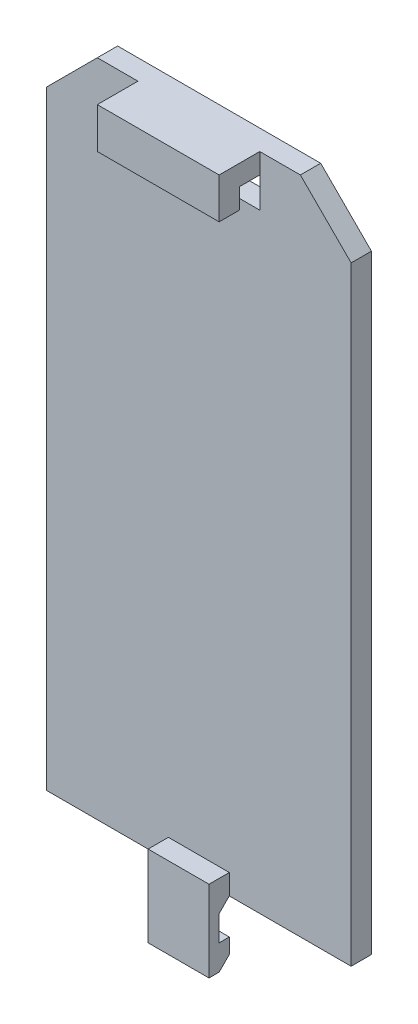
ISO-10303-21;
HEADER;
FILE_DESCRIPTION(('STEP AP214'),'2;1');
FILE_NAME('part.step','',(''),(''),'','','');
FILE_SCHEMA(('AUTOMOTIVE_DESIGN { 1 0 10303 214 1 1 1 1 }'));
ENDSEC;
DATA;
#1=APPLICATION_CONTEXT('core data for automotive mechanical design processes');
#2=APPLICATION_PROTOCOL_DEFINITION('international standard','automotive_design',2000,#1);
#3=PRODUCT_CONTEXT('',#1,'mechanical');
#4=PRODUCT('Part','Part','',(#3));
#5=PRODUCT_RELATED_PRODUCT_CATEGORY('part','',(#4));
#6=PRODUCT_DEFINITION_FORMATION('','',#4);
#7=PRODUCT_DEFINITION_CONTEXT('part definition',#1,'design');
#8=PRODUCT_DEFINITION('design','',#6,#7);
#9=PRODUCT_DEFINITION_SHAPE('','',#8);
#10=(LENGTH_UNIT() NAMED_UNIT(*) SI_UNIT(.MILLI.,.METRE.));
#11=(NAMED_UNIT(*) PLANE_ANGLE_UNIT() SI_UNIT($,.RADIAN.));
#12=(NAMED_UNIT(*) SI_UNIT($,.STERADIAN.) SOLID_ANGLE_UNIT());
#13=UNCERTAINTY_MEASURE_WITH_UNIT(LENGTH_MEASURE(1.E-05),#10,'distance_accuracy_value','');
#14=(GEOMETRIC_REPRESENTATION_CONTEXT(3) GLOBAL_UNCERTAINTY_ASSIGNED_CONTEXT((#13)) GLOBAL_UNIT_ASSIGNED_CONTEXT((#10,
#11,#12)) REPRESENTATION_CONTEXT('',''));
#15=CARTESIAN_POINT('',(0.,0.,0.));
#16=DIRECTION('',(0.,0.,1.));
#17=DIRECTION('',(1.,0.,0.));
#18=AXIS2_PLACEMENT_3D('',#15,#16,#17);
#19=CARTESIAN_POINT('',(-15.,65.,0.));
#20=DIRECTION('',(0.,0.,-1.));
#21=DIRECTION('',(-1.,0.,0.));
#22=AXIS2_PLACEMENT_3D('',#19,#20,#21);
#23=PLANE('',#22);
#24=DIRECTION('',(1.,0.,0.));
#25=VECTOR('',#24,1.);
#26=CARTESIAN_POINT('',(-8.,14.,0.));
#27=LINE('',#26,#25);
#28=CARTESIAN_POINT('',(-8.,14.,0.));
#29=VERTEX_POINT('',#28);
#30=CARTESIAN_POINT('',(8.,14.,0.));
#31=VERTEX_POINT('',#30);
#32=EDGE_CURVE('E337',#29,#31,#27,.T.);
#33=ORIENTED_EDGE('',*,*,#32,.F.);
#34=DIRECTION('',(0.,1.,0.));
#35=VECTOR('',#34,1.);
#36=CARTESIAN_POINT('',(-8.,14.,0.));
#37=LINE('',#36,#35);
#38=CARTESIAN_POINT('',(-8.,12.2,0.));
#39=VERTEX_POINT('',#38);
#40=EDGE_CURVE('E328',#39,#29,#37,.T.);
#41=ORIENTED_EDGE('',*,*,#40,.F.);
#42=DIRECTION('',(1.,0.,0.));
#43=VECTOR('',#42,1.);
#44=CARTESIAN_POINT('',(-8.,12.2,0.));
#45=LINE('',#44,#43);
#46=CARTESIAN_POINT('',(8.,12.2,0.));
#47=VERTEX_POINT('',#46);
#48=EDGE_CURVE('E338',#39,#47,#45,.T.);
#49=ORIENTED_EDGE('',*,*,#48,.T.);
#50=DIRECTION('',(0.,1.,0.));
#51=VECTOR('',#50,1.);
#52=CARTESIAN_POINT('',(8.,14.,0.));
#53=LINE('',#52,#51);
#54=EDGE_CURVE('E319',#47,#31,#53,.T.);
#55=ORIENTED_EDGE('',*,*,#54,.T.);
#56=EDGE_LOOP('',(#33,#41,#49,#55));
#57=FACE_BOUND('',#56,.T.);
#58=DIRECTION('',(1.,0.,0.));
#59=VECTOR('',#58,1.);
#60=CARTESIAN_POINT('',(-8.,10.,0.));
#61=LINE('',#60,#59);
#62=CARTESIAN_POINT('',(-8.,10.,0.));
#63=VERTEX_POINT('',#62);
#64=CARTESIAN_POINT('',(8.,9.99999999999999,0.));
#65=VERTEX_POINT('',#64);
#66=EDGE_CURVE('E388',#63,#65,#61,.T.);
#67=ORIENTED_EDGE('',*,*,#66,.F.);
#68=DIRECTION('',(0.,1.,0.));
#69=VECTOR('',#68,1.);
#70=CARTESIAN_POINT('',(-8.,10.,0.));
#71=LINE('',#70,#69);
#72=CARTESIAN_POINT('',(-8.,8.2,0.));
#73=VERTEX_POINT('',#72);
#74=EDGE_CURVE('E379',#73,#63,#71,.T.);
#75=ORIENTED_EDGE('',*,*,#74,.F.);
#76=DIRECTION('',(1.,0.,0.));
#77=VECTOR('',#76,1.);
#78=CARTESIAN_POINT('',(-8.,8.2,0.));
#79=LINE('',#78,#77);
#80=CARTESIAN_POINT('',(8.,8.2,0.));
#81=VERTEX_POINT('',#80);
#82=EDGE_CURVE('E389',#73,#81,#79,.T.);
#83=ORIENTED_EDGE('',*,*,#82,.T.);
#84=DIRECTION('',(0.,1.,0.));
#85=VECTOR('',#84,1.);
#86=CARTESIAN_POINT('',(8.,10.,0.));
#87=LINE('',#86,#85);
#88=EDGE_CURVE('E366',#81,#65,#87,.T.);
#89=ORIENTED_EDGE('',*,*,#88,.T.);
#90=EDGE_LOOP('',(#67,#75,#83,#89));
#91=FACE_BOUND('',#90,.T.);
#92=DIRECTION('',(0.,-1.,0.));
#93=VECTOR('',#92,1.);
#94=CARTESIAN_POINT('',(-15.,0.,0.));
#95=LINE('',#94,#93);
#96=CARTESIAN_POINT('',(-15.,60.,0.));
#97=VERTEX_POINT('',#96);
#98=CARTESIAN_POINT('',(-15.,0.,0.));
#99=VERTEX_POINT('',#98);
#100=EDGE_CURVE('E592',#97,#99,#95,.T.);
#101=ORIENTED_EDGE('',*,*,#100,.F.);
#102=DIRECTION('',(-0.707106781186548,-0.707106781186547,0.));
#103=VECTOR('',#102,1.);
#104=CARTESIAN_POINT('',(-15.,60.,0.));
#105=LINE('',#104,#103);
#106=CARTESIAN_POINT('',(-10.,65.,0.));
#107=VERTEX_POINT('',#106);
#108=EDGE_CURVE('E603',#107,#97,#105,.T.);
#109=ORIENTED_EDGE('',*,*,#108,.F.);
#110=DIRECTION('',(-1.,0.,0.));
#111=VECTOR('',#110,1.);
#112=CARTESIAN_POINT('',(-10.,65.,0.));
#113=LINE('',#112,#111);
#114=CARTESIAN_POINT('',(10.,65.,0.));
#115=VERTEX_POINT('',#114);
#116=EDGE_CURVE('E601',#115,#107,#113,.T.);
#117=ORIENTED_EDGE('',*,*,#116,.F.);
#118=DIRECTION('',(-0.707106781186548,0.707106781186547,0.));
#119=VECTOR('',#118,1.);
#120=CARTESIAN_POINT('',(10.,65.,0.));
#121=LINE('',#120,#119);
#122=CARTESIAN_POINT('',(15.,60.,0.));
#123=VERTEX_POINT('',#122);
#124=EDGE_CURVE('E599',#123,#115,#121,.T.);
#125=ORIENTED_EDGE('',*,*,#124,.F.);
#126=DIRECTION('',(0.,1.,0.));
#127=VECTOR('',#126,1.);
#128=CARTESIAN_POINT('',(15.,0.,0.));
#129=LINE('',#128,#127);
#130=CARTESIAN_POINT('',(15.,0.,0.));
#131=VERTEX_POINT('',#130);
#132=EDGE_CURVE('E597',#131,#123,#129,.T.);
#133=ORIENTED_EDGE('',*,*,#132,.F.);
#134=DIRECTION('',(1.,0.,0.));
#135=VECTOR('',#134,1.);
#136=CARTESIAN_POINT('',(-15.,0.,0.));
#137=LINE('',#136,#135);
#138=EDGE_CURVE('E595',#99,#131,#137,.T.);
#139=ORIENTED_EDGE('',*,*,#138,.F.);
#140=EDGE_LOOP('',(#101,#109,#117,#125,#133,#139));
#141=FACE_BOUND('',#140,.T.);
#142=DIRECTION('',(0.,-1.,0.));
#143=VECTOR('',#142,1.);
#144=CARTESIAN_POINT('',(-6.,63.,0.));
#145=LINE('',#144,#143);
#146=CARTESIAN_POINT('',(-6.,63.,0.));
#147=VERTEX_POINT('',#146);
#148=CARTESIAN_POINT('',(-6.,60.,0.));
#149=VERTEX_POINT('',#148);
#150=EDGE_CURVE('E568',#147,#149,#145,.T.);
#151=ORIENTED_EDGE('',*,*,#150,.T.);
#152=DIRECTION('',(1.,0.,0.));
#153=VECTOR('',#152,1.);
#154=CARTESIAN_POINT('',(-6.,60.,0.));
#155=LINE('',#154,#153);
#156=CARTESIAN_POINT('',(6.,60.,0.));
#157=VERTEX_POINT('',#156);
#158=EDGE_CURVE('E582',#149,#157,#155,.T.);
#159=ORIENTED_EDGE('',*,*,#158,.T.);
#160=DIRECTION('',(0.,1.,0.));
#161=VECTOR('',#160,1.);
#162=CARTESIAN_POINT('',(6.,63.,0.));
#163=LINE('',#162,#161);
#164=CARTESIAN_POINT('',(6.,63.,0.));
#165=VERTEX_POINT('',#164);
#166=EDGE_CURVE('E537',#157,#165,#163,.T.);
#167=ORIENTED_EDGE('',*,*,#166,.T.);
#168=DIRECTION('',(-1.,0.,0.));
#169=VECTOR('',#168,1.);
#170=CARTESIAN_POINT('',(-6.,63.,0.));
#171=LINE('',#170,#169);
#172=EDGE_CURVE('E565',#165,#147,#171,.T.);
#173=ORIENTED_EDGE('',*,*,#172,.T.);
#174=EDGE_LOOP('',(#151,#159,#167,#173));
#175=FACE_BOUND('',#174,.T.);
#176=DIRECTION('',(1.,0.,0.));
#177=VECTOR('',#176,1.);
#178=CARTESIAN_POINT('',(-8.,8.,0.));
#179=LINE('',#178,#177);
#180=CARTESIAN_POINT('',(-8.,8.,0.));
#181=VERTEX_POINT('',#180);
#182=CARTESIAN_POINT('',(8.,8.,0.));
#183=VERTEX_POINT('',#182);
#184=EDGE_CURVE('E420',#181,#183,#179,.T.);
#185=ORIENTED_EDGE('',*,*,#184,.F.);
#186=DIRECTION('',(0.,1.,0.));
#187=VECTOR('',#186,1.);
#188=CARTESIAN_POINT('',(-8.,8.,0.));
#189=LINE('',#188,#187);
#190=CARTESIAN_POINT('',(-8.,5.,0.));
#191=VERTEX_POINT('',#190);
#192=EDGE_CURVE('E408',#191,#181,#189,.T.);
#193=ORIENTED_EDGE('',*,*,#192,.F.);
#194=DIRECTION('',(1.,0.,0.));
#195=VECTOR('',#194,1.);
#196=CARTESIAN_POINT('',(-8.,5.,0.));
#197=LINE('',#196,#195);
#198=CARTESIAN_POINT('',(8.,5.,0.));
#199=VERTEX_POINT('',#198);
#200=EDGE_CURVE('E421',#191,#199,#197,.T.);
#201=ORIENTED_EDGE('',*,*,#200,.T.);
#202=DIRECTION('',(0.,1.,0.));
#203=VECTOR('',#202,1.);
#204=CARTESIAN_POINT('',(8.,8.,0.));
#205=LINE('',#204,#203);
#206=EDGE_CURVE('E392',#199,#183,#205,.T.);
#207=ORIENTED_EDGE('',*,*,#206,.T.);
#208=EDGE_LOOP('',(#185,#193,#201,#207));
#209=FACE_BOUND('',#208,.T.);
#210=DIRECTION('',(1.,0.,0.));
#211=VECTOR('',#210,1.);
#212=CARTESIAN_POINT('',(-8.,12.,0.));
#213=LINE('',#212,#211);
#214=CARTESIAN_POINT('',(-8.,12.,0.));
#215=VERTEX_POINT('',#214);
#216=CARTESIAN_POINT('',(8.,12.,0.));
#217=VERTEX_POINT('',#216);
#218=EDGE_CURVE('E362',#215,#217,#213,.T.);
#219=ORIENTED_EDGE('',*,*,#218,.F.);
#220=DIRECTION('',(0.,1.,0.));
#221=VECTOR('',#220,1.);
#222=CARTESIAN_POINT('',(-8.,12.,0.));
#223=LINE('',#222,#221);
#224=CARTESIAN_POINT('',(-8.,10.2,0.));
#225=VERTEX_POINT('',#224);
#226=EDGE_CURVE('E353',#225,#215,#223,.T.);
#227=ORIENTED_EDGE('',*,*,#226,.F.);
#228=DIRECTION('',(1.,0.,0.));
#229=VECTOR('',#228,1.);
#230=CARTESIAN_POINT('',(-8.,10.2,0.));
#231=LINE('',#230,#229);
#232=CARTESIAN_POINT('',(8.,10.2,0.));
#233=VERTEX_POINT('',#232);
#234=EDGE_CURVE('E363',#225,#233,#231,.T.);
#235=ORIENTED_EDGE('',*,*,#234,.T.);
#236=DIRECTION('',(0.,1.,0.));
#237=VECTOR('',#236,1.);
#238=CARTESIAN_POINT('',(8.,12.,0.));
#239=LINE('',#238,#237);
#240=EDGE_CURVE('E341',#233,#217,#239,.T.);
#241=ORIENTED_EDGE('',*,*,#240,.T.);
#242=EDGE_LOOP('',(#219,#227,#235,#241));
#243=FACE_BOUND('',#242,.T.);
#244=DIRECTION('',(1.,0.,0.));
#245=VECTOR('',#244,1.);
#246=CARTESIAN_POINT('',(-8.,16.,0.));
#247=LINE('',#246,#245);
#248=CARTESIAN_POINT('',(-8.,16.,0.));
#249=VERTEX_POINT('',#248);
#250=CARTESIAN_POINT('',(8.,16.,0.));
#251=VERTEX_POINT('',#250);
#252=EDGE_CURVE('E302',#249,#251,#247,.T.);
#253=ORIENTED_EDGE('',*,*,#252,.F.);
#254=DIRECTION('',(0.,1.,0.));
#255=VECTOR('',#254,1.);
#256=CARTESIAN_POINT('',(-8.,16.,0.));
#257=LINE('',#256,#255);
#258=CARTESIAN_POINT('',(-8.,14.2,0.));
#259=VERTEX_POINT('',#258);
#260=EDGE_CURVE('E310',#259,#249,#257,.T.);
#261=ORIENTED_EDGE('',*,*,#260,.F.);
#262=DIRECTION('',(1.,0.,0.));
#263=VECTOR('',#262,1.);
#264=CARTESIAN_POINT('',(-8.,14.2,0.));
#265=LINE('',#264,#263);
#266=CARTESIAN_POINT('',(8.,14.2,0.));
#267=VERTEX_POINT('',#266);
#268=EDGE_CURVE('E301',#259,#267,#265,.T.);
#269=ORIENTED_EDGE('',*,*,#268,.T.);
#270=DIRECTION('',(0.,1.,0.));
#271=VECTOR('',#270,1.);
#272=CARTESIAN_POINT('',(8.,16.,0.));
#273=LINE('',#272,#271);
#274=EDGE_CURVE('E307',#267,#251,#273,.T.);
#275=ORIENTED_EDGE('',*,*,#274,.T.);
#276=EDGE_LOOP('',(#253,#261,#269,#275));
#277=FACE_BOUND('',#276,.T.);
#278=ADVANCED_FACE('F32',(#57,#91,#141,#175,#209,#243,#277),#23,.T.);
#279=CARTESIAN_POINT('',(-15.,65.,2.));
#280=DIRECTION('',(0.,0.,-1.));
#281=DIRECTION('',(-1.,0.,0.));
#282=AXIS2_PLACEMENT_3D('',#279,#280,#281);
#283=PLANE('',#282);
#284=DIRECTION('',(0.,1.,0.));
#285=VECTOR('',#284,1.);
#286=CARTESIAN_POINT('',(3.,0.,2.));
#287=LINE('',#286,#285);
#288=CARTESIAN_POINT('',(3.,0.,2.));
#289=VERTEX_POINT('',#288);
#290=CARTESIAN_POINT('',(3.,2.,2.));
#291=VERTEX_POINT('',#290);
#292=EDGE_CURVE('E449',#289,#291,#287,.T.);
#293=ORIENTED_EDGE('',*,*,#292,.F.);
#294=DIRECTION('',(1.,0.,0.));
#295=VECTOR('',#294,1.);
#296=CARTESIAN_POINT('',(-15.,0.,2.));
#297=LINE('',#296,#295);
#298=CARTESIAN_POINT('',(15.,0.,2.));
#299=VERTEX_POINT('',#298);
#300=EDGE_CURVE('E608',#289,#299,#297,.T.);
#301=ORIENTED_EDGE('',*,*,#300,.T.);
#302=DIRECTION('',(0.,1.,0.));
#303=VECTOR('',#302,1.);
#304=CARTESIAN_POINT('',(15.,0.,2.));
#305=LINE('',#304,#303);
#306=CARTESIAN_POINT('',(15.,60.,2.));
#307=VERTEX_POINT('',#306);
#308=EDGE_CURVE('E612',#299,#307,#305,.T.);
#309=ORIENTED_EDGE('',*,*,#308,.T.);
#310=DIRECTION('',(-0.707106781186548,0.707106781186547,0.));
#311=VECTOR('',#310,1.);
#312=CARTESIAN_POINT('',(10.,65.,2.));
#313=LINE('',#312,#311);
#314=CARTESIAN_POINT('',(10.,65.,2.));
#315=VERTEX_POINT('',#314);
#316=EDGE_CURVE('E614',#307,#315,#313,.T.);
#317=ORIENTED_EDGE('',*,*,#316,.T.);
#318=DIRECTION('',(-1.,0.,0.));
#319=VECTOR('',#318,1.);
#320=CARTESIAN_POINT('',(-10.,65.,2.));
#321=LINE('',#320,#319);
#322=CARTESIAN_POINT('',(6.,65.,2.));
#323=VERTEX_POINT('',#322);
#324=EDGE_CURVE('E623',#315,#323,#321,.T.);
#325=ORIENTED_EDGE('',*,*,#324,.T.);
#326=DIRECTION('',(0.,1.,0.));
#327=VECTOR('',#326,1.);
#328=CARTESIAN_POINT('',(6.,63.,2.));
#329=LINE('',#328,#327);
#330=CARTESIAN_POINT('',(6.,63.,2.));
#331=VERTEX_POINT('',#330);
#332=EDGE_CURVE('E505',#331,#323,#329,.T.);
#333=ORIENTED_EDGE('',*,*,#332,.F.);
#334=DIRECTION('',(0.,1.,0.));
#335=VECTOR('',#334,1.);
#336=CARTESIAN_POINT('',(6.,63.,2.));
#337=LINE('',#336,#335);
#338=CARTESIAN_POINT('',(6.,60.,2.));
#339=VERTEX_POINT('',#338);
#340=EDGE_CURVE('E576',#339,#331,#337,.T.);
#341=ORIENTED_EDGE('',*,*,#340,.F.);
#342=DIRECTION('',(1.,0.,0.));
#343=VECTOR('',#342,1.);
#344=CARTESIAN_POINT('',(-6.,60.,2.));
#345=LINE('',#344,#343);
#346=CARTESIAN_POINT('',(-6.,60.,2.));
#347=VERTEX_POINT('',#346);
#348=EDGE_CURVE('E573',#347,#339,#345,.T.);
#349=ORIENTED_EDGE('',*,*,#348,.F.);
#350=DIRECTION('',(0.,-1.,0.));
#351=VECTOR('',#350,1.);
#352=CARTESIAN_POINT('',(-6.,63.,2.));
#353=LINE('',#352,#351);
#354=CARTESIAN_POINT('',(-6.,63.,2.));
#355=VERTEX_POINT('',#354);
#356=EDGE_CURVE('E571',#355,#347,#353,.T.);
#357=ORIENTED_EDGE('',*,*,#356,.F.);
#358=DIRECTION('',(0.,1.,0.));
#359=VECTOR('',#358,1.);
#360=CARTESIAN_POINT('',(-6.,63.,2.));
#361=LINE('',#360,#359);
#362=CARTESIAN_POINT('',(-6.,65.,2.));
#363=VERTEX_POINT('',#362);
#364=EDGE_CURVE('E494',#355,#363,#361,.T.);
#365=ORIENTED_EDGE('',*,*,#364,.T.);
#366=CARTESIAN_POINT('',(-10.,65.,2.));
#367=VERTEX_POINT('',#366);
#368=EDGE_CURVE('E529',#363,#367,#321,.T.);
#369=ORIENTED_EDGE('',*,*,#368,.T.);
#370=DIRECTION('',(-0.707106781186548,-0.707106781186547,0.));
#371=VECTOR('',#370,1.);
#372=CARTESIAN_POINT('',(-15.,60.,2.));
#373=LINE('',#372,#371);
#374=CARTESIAN_POINT('',(-15.,60.,2.));
#375=VERTEX_POINT('',#374);
#376=EDGE_CURVE('E618',#367,#375,#373,.T.);
#377=ORIENTED_EDGE('',*,*,#376,.T.);
#378=DIRECTION('',(0.,-1.,0.));
#379=VECTOR('',#378,1.);
#380=CARTESIAN_POINT('',(-15.,0.,2.));
#381=LINE('',#380,#379);
#382=CARTESIAN_POINT('',(-15.,0.,2.));
#383=VERTEX_POINT('',#382);
#384=EDGE_CURVE('E605',#375,#383,#381,.T.);
#385=ORIENTED_EDGE('',*,*,#384,.T.);
#386=CARTESIAN_POINT('',(-3.,0.,2.));
#387=VERTEX_POINT('',#386);
#388=EDGE_CURVE('E609',#383,#387,#297,.T.);
#389=ORIENTED_EDGE('',*,*,#388,.T.);
#390=DIRECTION('',(0.,1.,0.));
#391=VECTOR('',#390,1.);
#392=CARTESIAN_POINT('',(-3.,0.,2.));
#393=LINE('',#392,#391);
#394=CARTESIAN_POINT('',(-3.,2.,2.));
#395=VERTEX_POINT('',#394);
#396=EDGE_CURVE('E424',#387,#395,#393,.T.);
#397=ORIENTED_EDGE('',*,*,#396,.T.);
#398=DIRECTION('',(-1.,0.,0.));
#399=VECTOR('',#398,1.);
#400=CARTESIAN_POINT('',(3.,2.,2.));
#401=LINE('',#400,#399);
#402=EDGE_CURVE('E492',#291,#395,#401,.T.);
#403=ORIENTED_EDGE('',*,*,#402,.F.);
#404=EDGE_LOOP('',(#293,#301,#309,#317,#325,#333,#341,#349,#357,#365,#369,#377,#385,#389,#397,#403));
#405=FACE_BOUND('',#404,.T.);
#406=ADVANCED_FACE('F644',(#405),#283,.F.);
#407=CARTESIAN_POINT('',(-15.,0.,2.));
#408=DIRECTION('',(1.,0.,0.));
#409=DIRECTION('',(0.,0.,-1.));
#410=AXIS2_PLACEMENT_3D('',#407,#408,#409);
#411=PLANE('',#410);
#412=ORIENTED_EDGE('',*,*,#100,.T.);
#413=DIRECTION('',(0.,0.,-1.));
#414=VECTOR('',#413,1.);
#415=CARTESIAN_POINT('',(-15.,0.,2.));
#416=LINE('',#415,#414);
#417=EDGE_CURVE('E11',#383,#99,#416,.T.);
#418=ORIENTED_EDGE('',*,*,#417,.F.);
#419=ORIENTED_EDGE('',*,*,#384,.F.);
#420=DIRECTION('',(0.,0.,-1.));
#421=VECTOR('',#420,1.);
#422=CARTESIAN_POINT('',(-15.,60.,2.));
#423=LINE('',#422,#421);
#424=EDGE_CURVE('E635',#375,#97,#423,.T.);
#425=ORIENTED_EDGE('',*,*,#424,.T.);
#426=EDGE_LOOP('',(#412,#418,#419,#425));
#427=FACE_BOUND('',#426,.T.);
#428=ADVANCED_FACE('F34',(#427),#411,.F.);
#429=CARTESIAN_POINT('',(-15.,0.,2.));
#430=DIRECTION('',(0.,1.,0.));
#431=DIRECTION('',(0.,0.,1.));
#432=AXIS2_PLACEMENT_3D('',#429,#430,#431);
#433=PLANE('',#432);
#434=ORIENTED_EDGE('',*,*,#138,.T.);
#435=DIRECTION('',(0.,0.,-1.));
#436=VECTOR('',#435,1.);
#437=CARTESIAN_POINT('',(15.,0.,2.));
#438=LINE('',#437,#436);
#439=EDGE_CURVE('E41',#299,#131,#438,.T.);
#440=ORIENTED_EDGE('',*,*,#439,.F.);
#441=ORIENTED_EDGE('',*,*,#300,.F.);
#442=DIRECTION('',(-1.,0.,0.));
#443=VECTOR('',#442,1.);
#444=CARTESIAN_POINT('',(3.,0.,2.));
#445=LINE('',#444,#443);
#446=EDGE_CURVE('E468',#289,#387,#445,.T.);
#447=ORIENTED_EDGE('',*,*,#446,.T.);
#448=ORIENTED_EDGE('',*,*,#388,.F.);
#449=ORIENTED_EDGE('',*,*,#417,.T.);
#450=EDGE_LOOP('',(#434,#440,#441,#447,#448,#449));
#451=FACE_BOUND('',#450,.T.);
#452=ADVANCED_FACE('F650',(#451),#433,.F.);
#453=CARTESIAN_POINT('',(15.,0.,2.));
#454=DIRECTION('',(-1.,0.,0.));
#455=DIRECTION('',(0.,0.,1.));
#456=AXIS2_PLACEMENT_3D('',#453,#454,#455);
#457=PLANE('',#456);
#458=ORIENTED_EDGE('',*,*,#132,.T.);
#459=DIRECTION('',(0.,0.,-1.));
#460=VECTOR('',#459,1.);
#461=CARTESIAN_POINT('',(15.,60.,2.));
#462=LINE('',#461,#460);
#463=EDGE_CURVE('E627',#307,#123,#462,.T.);
#464=ORIENTED_EDGE('',*,*,#463,.F.);
#465=ORIENTED_EDGE('',*,*,#308,.F.);
#466=ORIENTED_EDGE('',*,*,#439,.T.);
#467=EDGE_LOOP('',(#458,#464,#465,#466));
#468=FACE_BOUND('',#467,.T.);
#469=ADVANCED_FACE('F679',(#468),#457,.F.);
#470=CARTESIAN_POINT('',(10.,65.,2.));
#471=DIRECTION('',(-0.707106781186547,-0.707106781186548,0.));
#472=DIRECTION('',(0.707106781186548,-0.707106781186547,0.));
#473=AXIS2_PLACEMENT_3D('',#470,#471,#472);
#474=PLANE('',#473);
#475=ORIENTED_EDGE('',*,*,#124,.T.);
#476=DIRECTION('',(0.,0.,-1.));
#477=VECTOR('',#476,1.);
#478=CARTESIAN_POINT('',(10.,65.,2.));
#479=LINE('',#478,#477);
#480=EDGE_CURVE('E630',#315,#115,#479,.T.);
#481=ORIENTED_EDGE('',*,*,#480,.F.);
#482=ORIENTED_EDGE('',*,*,#316,.F.);
#483=ORIENTED_EDGE('',*,*,#463,.T.);
#484=EDGE_LOOP('',(#475,#481,#482,#483));
#485=FACE_BOUND('',#484,.T.);
#486=ADVANCED_FACE('F684',(#485),#474,.F.);
#487=CARTESIAN_POINT('',(-10.,65.,2.));
#488=DIRECTION('',(0.,-1.,0.));
#489=DIRECTION('',(0.,0.,-1.));
#490=AXIS2_PLACEMENT_3D('',#487,#488,#489);
#491=PLANE('',#490);
#492=ORIENTED_EDGE('',*,*,#116,.T.);
#493=DIRECTION('',(0.,0.,-1.));
#494=VECTOR('',#493,1.);
#495=CARTESIAN_POINT('',(-10.,65.,2.));
#496=LINE('',#495,#494);
#497=EDGE_CURVE('E633',#367,#107,#496,.T.);
#498=ORIENTED_EDGE('',*,*,#497,.F.);
#499=ORIENTED_EDGE('',*,*,#368,.F.);
#500=DIRECTION('',(0.,0.,1.));
#501=VECTOR('',#500,1.);
#502=CARTESIAN_POINT('',(-6.,65.,6.));
#503=LINE('',#502,#501);
#504=CARTESIAN_POINT('',(-6.,65.,6.));
#505=VERTEX_POINT('',#504);
#506=EDGE_CURVE('E498',#363,#505,#503,.T.);
#507=ORIENTED_EDGE('',*,*,#506,.T.);
#508=DIRECTION('',(-1.,0.,0.));
#509=VECTOR('',#508,1.);
#510=CARTESIAN_POINT('',(6.,65.,6.));
#511=LINE('',#510,#509);
#512=CARTESIAN_POINT('',(6.,65.,6.));
#513=VERTEX_POINT('',#512);
#514=EDGE_CURVE('E526',#513,#505,#511,.T.);
#515=ORIENTED_EDGE('',*,*,#514,.F.);
#516=DIRECTION('',(0.,0.,1.));
#517=VECTOR('',#516,1.);
#518=CARTESIAN_POINT('',(6.,65.,6.));
#519=LINE('',#518,#517);
#520=EDGE_CURVE('E514',#323,#513,#519,.T.);
#521=ORIENTED_EDGE('',*,*,#520,.F.);
#522=ORIENTED_EDGE('',*,*,#324,.F.);
#523=ORIENTED_EDGE('',*,*,#480,.T.);
#524=EDGE_LOOP('',(#492,#498,#499,#507,#515,#521,#522,#523));
#525=FACE_BOUND('',#524,.T.);
#526=ADVANCED_FACE('F524',(#525),#491,.F.);
#527=CARTESIAN_POINT('',(-15.,60.,2.));
#528=DIRECTION('',(0.707106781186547,-0.707106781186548,0.));
#529=DIRECTION('',(0.707106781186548,0.707106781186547,0.));
#530=AXIS2_PLACEMENT_3D('',#527,#528,#529);
#531=PLANE('',#530);
#532=ORIENTED_EDGE('',*,*,#108,.T.);
#533=ORIENTED_EDGE('',*,*,#424,.F.);
#534=ORIENTED_EDGE('',*,*,#376,.F.);
#535=ORIENTED_EDGE('',*,*,#497,.T.);
#536=EDGE_LOOP('',(#532,#533,#534,#535));
#537=FACE_BOUND('',#536,.T.);
#538=ADVANCED_FACE('F647',(#537),#531,.F.);
#539=CARTESIAN_POINT('',(-6.,63.,-0.00100000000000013));
#540=DIRECTION('',(-1.,0.,0.));
#541=DIRECTION('',(0.,0.,1.));
#542=AXIS2_PLACEMENT_3D('',#539,#540,#541);
#543=PLANE('',#542);
#544=DIRECTION('',(0.,0.,1.));
#545=VECTOR('',#544,1.);
#546=CARTESIAN_POINT('',(-6.,63.,-0.00100000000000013));
#547=LINE('',#546,#545);
#548=EDGE_CURVE('E580',#147,#355,#547,.T.);
#549=ORIENTED_EDGE('',*,*,#548,.T.);
#550=ORIENTED_EDGE('',*,*,#356,.T.);
#551=DIRECTION('',(0.,0.,1.));
#552=VECTOR('',#551,1.);
#553=CARTESIAN_POINT('',(-6.,60.,-0.00100000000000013));
#554=LINE('',#553,#552);
#555=EDGE_CURVE('E579',#149,#347,#554,.T.);
#556=ORIENTED_EDGE('',*,*,#555,.F.);
#557=ORIENTED_EDGE('',*,*,#150,.F.);
#558=EDGE_LOOP('',(#549,#550,#556,#557));
#559=FACE_BOUND('',#558,.T.);
#560=ADVANCED_FACE('F707',(#559),#543,.F.);
#561=CARTESIAN_POINT('',(-6.,63.,-0.00100000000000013));
#562=DIRECTION('',(0.,1.,0.));
#563=DIRECTION('',(0.,0.,1.));
#564=AXIS2_PLACEMENT_3D('',#561,#562,#563);
#565=PLANE('',#564);
#566=DIRECTION('',(0.,0.,1.));
#567=VECTOR('',#566,1.);
#568=CARTESIAN_POINT('',(6.,63.,-0.00100000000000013));
#569=LINE('',#568,#567);
#570=EDGE_CURVE('E583',#165,#331,#569,.T.);
#571=ORIENTED_EDGE('',*,*,#570,.T.);
#572=DIRECTION('',(0.,0.,-1.));
#573=VECTOR('',#572,1.);
#574=CARTESIAN_POINT('',(6.,63.,2.));
#575=LINE('',#574,#573);
#576=CARTESIAN_POINT('',(6.,63.,4.));
#577=VERTEX_POINT('',#576);
#578=EDGE_CURVE('E559',#577,#331,#575,.T.);
#579=ORIENTED_EDGE('',*,*,#578,.F.);
#580=DIRECTION('',(-1.,0.,0.));
#581=VECTOR('',#580,1.);
#582=CARTESIAN_POINT('',(6.,63.,4.));
#583=LINE('',#582,#581);
#584=CARTESIAN_POINT('',(-6.,63.,4.));
#585=VERTEX_POINT('',#584);
#586=EDGE_CURVE('E556',#577,#585,#583,.T.);
#587=ORIENTED_EDGE('',*,*,#586,.T.);
#588=DIRECTION('',(0.,0.,-1.));
#589=VECTOR('',#588,1.);
#590=CARTESIAN_POINT('',(-6.,63.,2.));
#591=LINE('',#590,#589);
#592=EDGE_CURVE('E502',#585,#355,#591,.T.);
#593=ORIENTED_EDGE('',*,*,#592,.T.);
#594=ORIENTED_EDGE('',*,*,#548,.F.);
#595=ORIENTED_EDGE('',*,*,#172,.F.);
#596=EDGE_LOOP('',(#571,#579,#587,#593,#594,#595));
#597=FACE_BOUND('',#596,.T.);
#598=ADVANCED_FACE('F695',(#597),#565,.F.);
#599=CARTESIAN_POINT('',(6.,63.,-0.00100000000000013));
#600=DIRECTION('',(1.,0.,0.));
#601=DIRECTION('',(0.,0.,-1.));
#602=AXIS2_PLACEMENT_3D('',#599,#600,#601);
#603=PLANE('',#602);
#604=DIRECTION('',(0.,0.,1.));
#605=VECTOR('',#604,1.);
#606=CARTESIAN_POINT('',(6.,60.,-0.00100000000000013));
#607=LINE('',#606,#605);
#608=EDGE_CURVE('E586',#157,#339,#607,.T.);
#609=ORIENTED_EDGE('',*,*,#608,.T.);
#610=ORIENTED_EDGE('',*,*,#340,.T.);
#611=ORIENTED_EDGE('',*,*,#570,.F.);
#612=ORIENTED_EDGE('',*,*,#166,.F.);
#613=EDGE_LOOP('',(#609,#610,#611,#612));
#614=FACE_BOUND('',#613,.T.);
#615=ADVANCED_FACE('F699',(#614),#603,.F.);
#616=CARTESIAN_POINT('',(-6.,60.,-0.00100000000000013));
#617=DIRECTION('',(0.,-1.,0.));
#618=DIRECTION('',(0.,0.,-1.));
#619=AXIS2_PLACEMENT_3D('',#616,#617,#618);
#620=PLANE('',#619);
#621=ORIENTED_EDGE('',*,*,#555,.T.);
#622=ORIENTED_EDGE('',*,*,#348,.T.);
#623=ORIENTED_EDGE('',*,*,#608,.F.);
#624=ORIENTED_EDGE('',*,*,#158,.F.);
#625=EDGE_LOOP('',(#621,#622,#623,#624));
#626=FACE_BOUND('',#625,.T.);
#627=ADVANCED_FACE('F701',(#626),#620,.F.);
#628=CARTESIAN_POINT('',(6.,61.,6.));
#629=DIRECTION('',(0.,0.,-1.));
#630=DIRECTION('',(0.,1.,0.));
#631=AXIS2_PLACEMENT_3D('',#628,#629,#630);
#632=PLANE('',#631);
#633=DIRECTION('',(0.,-1.,0.));
#634=VECTOR('',#633,1.);
#635=CARTESIAN_POINT('',(-6.,61.,6.));
#636=LINE('',#635,#634);
#637=CARTESIAN_POINT('',(-6.,61.,6.));
#638=VERTEX_POINT('',#637);
#639=EDGE_CURVE('E495',#505,#638,#636,.T.);
#640=ORIENTED_EDGE('',*,*,#639,.T.);
#641=DIRECTION('',(-1.,0.,0.));
#642=VECTOR('',#641,1.);
#643=CARTESIAN_POINT('',(6.,61.,6.));
#644=LINE('',#643,#642);
#645=CARTESIAN_POINT('',(6.,61.,6.));
#646=VERTEX_POINT('',#645);
#647=EDGE_CURVE('E538',#646,#638,#644,.T.);
#648=ORIENTED_EDGE('',*,*,#647,.F.);
#649=DIRECTION('',(0.,-1.,0.));
#650=VECTOR('',#649,1.);
#651=CARTESIAN_POINT('',(6.,61.,6.));
#652=LINE('',#651,#650);
#653=EDGE_CURVE('E508',#513,#646,#652,.T.);
#654=ORIENTED_EDGE('',*,*,#653,.F.);
#655=ORIENTED_EDGE('',*,*,#514,.T.);
#656=EDGE_LOOP('',(#640,#648,#654,#655));
#657=FACE_BOUND('',#656,.T.);
#658=ADVANCED_FACE('F534',(#657),#632,.F.);
#659=CARTESIAN_POINT('',(6.,61.,4.));
#660=DIRECTION('',(0.,1.,0.));
#661=DIRECTION('',(0.,0.,1.));
#662=AXIS2_PLACEMENT_3D('',#659,#660,#661);
#663=PLANE('',#662);
#664=DIRECTION('',(0.,0.,-1.));
#665=VECTOR('',#664,1.);
#666=CARTESIAN_POINT('',(-6.,61.,4.));
#667=LINE('',#666,#665);
#668=CARTESIAN_POINT('',(-6.,61.,4.));
#669=VERTEX_POINT('',#668);
#670=EDGE_CURVE('E497',#638,#669,#667,.T.);
#671=ORIENTED_EDGE('',*,*,#670,.T.);
#672=DIRECTION('',(-1.,0.,0.));
#673=VECTOR('',#672,1.);
#674=CARTESIAN_POINT('',(6.,61.,4.));
#675=LINE('',#674,#673);
#676=CARTESIAN_POINT('',(6.,61.,4.));
#677=VERTEX_POINT('',#676);
#678=EDGE_CURVE('E549',#677,#669,#675,.T.);
#679=ORIENTED_EDGE('',*,*,#678,.F.);
#680=DIRECTION('',(0.,0.,-1.));
#681=VECTOR('',#680,1.);
#682=CARTESIAN_POINT('',(6.,61.,4.));
#683=LINE('',#682,#681);
#684=EDGE_CURVE('E1177',#646,#677,#683,.T.);
#685=ORIENTED_EDGE('',*,*,#684,.F.);
#686=ORIENTED_EDGE('',*,*,#647,.T.);
#687=EDGE_LOOP('',(#671,#679,#685,#686));
#688=FACE_BOUND('',#687,.T.);
#689=ADVANCED_FACE('F547',(#688),#663,.F.);
#690=CARTESIAN_POINT('',(6.,63.,4.));
#691=DIRECTION('',(0.,0.,1.));
#692=DIRECTION('',(0.,-1.,0.));
#693=AXIS2_PLACEMENT_3D('',#690,#691,#692);
#694=PLANE('',#693);
#695=DIRECTION('',(0.,1.,0.));
#696=VECTOR('',#695,1.);
#697=CARTESIAN_POINT('',(-6.,63.,4.));
#698=LINE('',#697,#696);
#699=EDGE_CURVE('E500',#669,#585,#698,.T.);
#700=ORIENTED_EDGE('',*,*,#699,.T.);
#701=ORIENTED_EDGE('',*,*,#586,.F.);
#702=DIRECTION('',(0.,1.,0.));
#703=VECTOR('',#702,1.);
#704=CARTESIAN_POINT('',(6.,63.,4.));
#705=LINE('',#704,#703);
#706=EDGE_CURVE('E555',#677,#577,#705,.T.);
#707=ORIENTED_EDGE('',*,*,#706,.F.);
#708=ORIENTED_EDGE('',*,*,#678,.T.);
#709=EDGE_LOOP('',(#700,#701,#707,#708));
#710=FACE_BOUND('',#709,.T.);
#711=ADVANCED_FACE('F552',(#710),#694,.F.);
#712=CARTESIAN_POINT('',(6.,65.,2.));
#713=DIRECTION('',(-1.,0.,0.));
#714=DIRECTION('',(0.,0.,1.));
#715=AXIS2_PLACEMENT_3D('',#712,#713,#714);
#716=PLANE('',#715);
#717=ORIENTED_EDGE('',*,*,#332,.T.);
#718=ORIENTED_EDGE('',*,*,#520,.T.);
#719=ORIENTED_EDGE('',*,*,#653,.T.);
#720=ORIENTED_EDGE('',*,*,#684,.T.);
#721=ORIENTED_EDGE('',*,*,#706,.T.);
#722=ORIENTED_EDGE('',*,*,#578,.T.);
#723=EDGE_LOOP('',(#717,#718,#719,#720,#721,#722));
#724=FACE_BOUND('',#723,.T.);
#725=ADVANCED_FACE('F689',(#724),#716,.F.);
#726=CARTESIAN_POINT('',(-6.,65.,2.));
#727=DIRECTION('',(-1.,0.,0.));
#728=DIRECTION('',(0.,0.,1.));
#729=AXIS2_PLACEMENT_3D('',#726,#727,#728);
#730=PLANE('',#729);
#731=ORIENTED_EDGE('',*,*,#364,.F.);
#732=ORIENTED_EDGE('',*,*,#592,.F.);
#733=ORIENTED_EDGE('',*,*,#699,.F.);
#734=ORIENTED_EDGE('',*,*,#670,.F.);
#735=ORIENTED_EDGE('',*,*,#639,.F.);
#736=ORIENTED_EDGE('',*,*,#506,.F.);
#737=EDGE_LOOP('',(#731,#732,#733,#734,#735,#736));
#738=FACE_BOUND('',#737,.T.);
#739=ADVANCED_FACE('F541',(#738),#730,.T.);
#740=CARTESIAN_POINT('',(3.,2.,2.));
#741=DIRECTION('',(0.,-1.,0.));
#742=DIRECTION('',(0.,0.,-1.));
#743=AXIS2_PLACEMENT_3D('',#740,#741,#742);
#744=PLANE('',#743);
#745=DIRECTION('',(0.,0.,1.));
#746=VECTOR('',#745,1.);
#747=CARTESIAN_POINT('',(-3.,2.,2.));
#748=LINE('',#747,#746);
#749=CARTESIAN_POINT('',(-3.,2.,4.));
#750=VERTEX_POINT('',#749);
#751=EDGE_CURVE('E433',#395,#750,#748,.T.);
#752=ORIENTED_EDGE('',*,*,#751,.T.);
#753=DIRECTION('',(-1.,0.,0.));
#754=VECTOR('',#753,1.);
#755=CARTESIAN_POINT('',(3.,2.,4.));
#756=LINE('',#755,#754);
#757=CARTESIAN_POINT('',(3.,2.,4.));
#758=VERTEX_POINT('',#757);
#759=EDGE_CURVE('E489',#758,#750,#756,.T.);
#760=ORIENTED_EDGE('',*,*,#759,.F.);
#761=DIRECTION('',(0.,0.,1.));
#762=VECTOR('',#761,1.);
#763=CARTESIAN_POINT('',(3.,2.,2.));
#764=LINE('',#763,#762);
#765=EDGE_CURVE('E452',#291,#758,#764,.T.);
#766=ORIENTED_EDGE('',*,*,#765,.F.);
#767=ORIENTED_EDGE('',*,*,#402,.T.);
#768=EDGE_LOOP('',(#752,#760,#766,#767));
#769=FACE_BOUND('',#768,.T.);
#770=ADVANCED_FACE('F665',(#769),#744,.F.);
#771=CARTESIAN_POINT('',(3.,2.,4.));
#772=DIRECTION('',(0.,0.,-1.));
#773=DIRECTION('',(0.,1.,0.));
#774=AXIS2_PLACEMENT_3D('',#771,#772,#773);
#775=PLANE('',#774);
#776=DIRECTION('',(0.,-1.,0.));
#777=VECTOR('',#776,1.);
#778=CARTESIAN_POINT('',(-3.,2.,4.));
#779=LINE('',#778,#777);
#780=CARTESIAN_POINT('',(-3.,-6.,4.));
#781=VERTEX_POINT('',#780);
#782=EDGE_CURVE('E435',#750,#781,#779,.T.);
#783=ORIENTED_EDGE('',*,*,#782,.T.);
#784=DIRECTION('',(-1.,0.,0.));
#785=VECTOR('',#784,1.);
#786=CARTESIAN_POINT('',(3.,-6.,4.));
#787=LINE('',#786,#785);
#788=CARTESIAN_POINT('',(3.,-6.,4.));
#789=VERTEX_POINT('',#788);
#790=EDGE_CURVE('E486',#789,#781,#787,.T.);
#791=ORIENTED_EDGE('',*,*,#790,.F.);
#792=DIRECTION('',(0.,-1.,0.));
#793=VECTOR('',#792,1.);
#794=CARTESIAN_POINT('',(3.,2.,4.));
#795=LINE('',#794,#793);
#796=EDGE_CURVE('E454',#758,#789,#795,.T.);
#797=ORIENTED_EDGE('',*,*,#796,.F.);
#798=ORIENTED_EDGE('',*,*,#759,.T.);
#799=EDGE_LOOP('',(#783,#791,#797,#798));
#800=FACE_BOUND('',#799,.T.);
#801=ADVANCED_FACE('F668',(#800),#775,.F.);
#802=CARTESIAN_POINT('',(3.,-6.,4.));
#803=DIRECTION('',(0.,1.,0.));
#804=DIRECTION('',(0.,0.,1.));
#805=AXIS2_PLACEMENT_3D('',#802,#803,#804);
#806=PLANE('',#805);
#807=DIRECTION('',(0.,0.,-1.));
#808=VECTOR('',#807,1.);
#809=CARTESIAN_POINT('',(-3.,-6.,4.));
#810=LINE('',#809,#808);
#811=CARTESIAN_POINT('',(-3.,-6.,2.99999999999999));
#812=VERTEX_POINT('',#811);
#813=EDGE_CURVE('E437',#781,#812,#810,.T.);
#814=ORIENTED_EDGE('',*,*,#813,.T.);
#815=DIRECTION('',(-1.,0.,0.));
#816=VECTOR('',#815,1.);
#817=CARTESIAN_POINT('',(3.,-6.,2.99999999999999));
#818=LINE('',#817,#816);
#819=CARTESIAN_POINT('',(3.,-6.,2.99999999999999));
#820=VERTEX_POINT('',#819);
#821=EDGE_CURVE('E483',#820,#812,#818,.T.);
#822=ORIENTED_EDGE('',*,*,#821,.F.);
#823=DIRECTION('',(0.,0.,-1.));
#824=VECTOR('',#823,1.);
#825=CARTESIAN_POINT('',(3.,-6.,4.));
#826=LINE('',#825,#824);
#827=EDGE_CURVE('E456',#789,#820,#826,.T.);
#828=ORIENTED_EDGE('',*,*,#827,.F.);
#829=ORIENTED_EDGE('',*,*,#790,.T.);
#830=EDGE_LOOP('',(#814,#822,#828,#829));
#831=FACE_BOUND('',#830,.T.);
#832=ADVANCED_FACE('F770',(#831),#806,.F.);
#833=CARTESIAN_POINT('',(3.,-6.,2.99999999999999));
#834=DIRECTION('',(0.,0.707106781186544,0.707106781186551));
#835=DIRECTION('',(0.,-0.707106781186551,0.707106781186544));
#836=AXIS2_PLACEMENT_3D('',#833,#834,#835);
#837=PLANE('',#836);
#838=DIRECTION('',(0.,0.707106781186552,-0.707106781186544));
#839=VECTOR('',#838,1.);
#840=CARTESIAN_POINT('',(-3.,-6.,2.99999999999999));
#841=LINE('',#840,#839);
#842=CARTESIAN_POINT('',(-3.,-5.,2.));
#843=VERTEX_POINT('',#842);
#844=EDGE_CURVE('E439',#812,#843,#841,.T.);
#845=ORIENTED_EDGE('',*,*,#844,.T.);
#846=DIRECTION('',(-1.,0.,0.));
#847=VECTOR('',#846,1.);
#848=CARTESIAN_POINT('',(3.,-5.,2.));
#849=LINE('',#848,#847);
#850=CARTESIAN_POINT('',(3.,-5.,2.));
#851=VERTEX_POINT('',#850);
#852=EDGE_CURVE('E480',#851,#843,#849,.T.);
#853=ORIENTED_EDGE('',*,*,#852,.F.);
#854=DIRECTION('',(0.,0.707106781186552,-0.707106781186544));
#855=VECTOR('',#854,1.);
#856=CARTESIAN_POINT('',(3.,-6.,2.99999999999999));
#857=LINE('',#856,#855);
#858=EDGE_CURVE('E458',#820,#851,#857,.T.);
#859=ORIENTED_EDGE('',*,*,#858,.F.);
#860=ORIENTED_EDGE('',*,*,#821,.T.);
#861=EDGE_LOOP('',(#845,#853,#859,#860));
#862=FACE_BOUND('',#861,.T.);
#863=ADVANCED_FACE('F779',(#862),#837,.F.);
#864=CARTESIAN_POINT('',(3.,-5.,2.));
#865=DIRECTION('',(0.,0.,1.));
#866=DIRECTION('',(1.,0.,0.));
#867=AXIS2_PLACEMENT_3D('',#864,#865,#866);
#868=PLANE('',#867);
#869=DIRECTION('',(0.,1.,0.));
#870=VECTOR('',#869,1.);
#871=CARTESIAN_POINT('',(-3.,-5.,2.));
#872=LINE('',#871,#870);
#873=CARTESIAN_POINT('',(-3.,-3.5,2.));
#874=VERTEX_POINT('',#873);
#875=EDGE_CURVE('E441',#843,#874,#872,.T.);
#876=ORIENTED_EDGE('',*,*,#875,.T.);
#877=DIRECTION('',(-1.,0.,0.));
#878=VECTOR('',#877,1.);
#879=CARTESIAN_POINT('',(3.,-3.5,2.));
#880=LINE('',#879,#878);
#881=CARTESIAN_POINT('',(3.,-3.5,2.));
#882=VERTEX_POINT('',#881);
#883=EDGE_CURVE('E477',#882,#874,#880,.T.);
#884=ORIENTED_EDGE('',*,*,#883,.F.);
#885=DIRECTION('',(0.,1.,0.));
#886=VECTOR('',#885,1.);
#887=CARTESIAN_POINT('',(3.,-5.,2.));
#888=LINE('',#887,#886);
#889=EDGE_CURVE('E460',#851,#882,#888,.T.);
#890=ORIENTED_EDGE('',*,*,#889,.F.);
#891=ORIENTED_EDGE('',*,*,#852,.T.);
#892=EDGE_LOOP('',(#876,#884,#890,#891));
#893=FACE_BOUND('',#892,.T.);
#894=ADVANCED_FACE('F789',(#893),#868,.F.);
#895=CARTESIAN_POINT('',(3.,-3.5,2.));
#896=DIRECTION('',(0.,-1.,0.));
#897=DIRECTION('',(0.,0.,-1.));
#898=AXIS2_PLACEMENT_3D('',#895,#896,#897);
#899=PLANE('',#898);
#900=DIRECTION('',(0.,0.,1.));
#901=VECTOR('',#900,1.);
#902=CARTESIAN_POINT('',(-3.,-3.5,2.));
#903=LINE('',#902,#901);
#904=CARTESIAN_POINT('',(-3.,-3.5,3.));
#905=VERTEX_POINT('',#904);
#906=EDGE_CURVE('E443',#874,#905,#903,.T.);
#907=ORIENTED_EDGE('',*,*,#906,.T.);
#908=DIRECTION('',(-1.,0.,0.));
#909=VECTOR('',#908,1.);
#910=CARTESIAN_POINT('',(3.,-3.5,3.));
#911=LINE('',#910,#909);
#912=CARTESIAN_POINT('',(3.,-3.5,3.));
#913=VERTEX_POINT('',#912);
#914=EDGE_CURVE('E474',#913,#905,#911,.T.);
#915=ORIENTED_EDGE('',*,*,#914,.F.);
#916=DIRECTION('',(0.,0.,1.));
#917=VECTOR('',#916,1.);
#918=CARTESIAN_POINT('',(3.,-3.5,2.));
#919=LINE('',#918,#917);
#920=EDGE_CURVE('E462',#882,#913,#919,.T.);
#921=ORIENTED_EDGE('',*,*,#920,.F.);
#922=ORIENTED_EDGE('',*,*,#883,.T.);
#923=EDGE_LOOP('',(#907,#915,#921,#922));
#924=FACE_BOUND('',#923,.T.);
#925=ADVANCED_FACE('F799',(#924),#899,.F.);
#926=CARTESIAN_POINT('',(3.,-3.5,3.));
#927=DIRECTION('',(0.,0.,1.));
#928=DIRECTION('',(1.,0.,0.));
#929=AXIS2_PLACEMENT_3D('',#926,#927,#928);
#930=PLANE('',#929);
#931=DIRECTION('',(0.,1.,0.));
#932=VECTOR('',#931,1.);
#933=CARTESIAN_POINT('',(-3.,-3.5,3.));
#934=LINE('',#933,#932);
#935=CARTESIAN_POINT('',(-3.,-1.00000000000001,3.));
#936=VERTEX_POINT('',#935);
#937=EDGE_CURVE('E445',#905,#936,#934,.T.);
#938=ORIENTED_EDGE('',*,*,#937,.T.);
#939=DIRECTION('',(-1.,0.,0.));
#940=VECTOR('',#939,1.);
#941=CARTESIAN_POINT('',(3.,-1.00000000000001,3.));
#942=LINE('',#941,#940);
#943=CARTESIAN_POINT('',(3.,-1.00000000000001,3.));
#944=VERTEX_POINT('',#943);
#945=EDGE_CURVE('E471',#944,#936,#942,.T.);
#946=ORIENTED_EDGE('',*,*,#945,.F.);
#947=DIRECTION('',(0.,1.,0.));
#948=VECTOR('',#947,1.);
#949=CARTESIAN_POINT('',(3.,-3.5,3.));
#950=LINE('',#949,#948);
#951=EDGE_CURVE('E464',#913,#944,#950,.T.);
#952=ORIENTED_EDGE('',*,*,#951,.F.);
#953=ORIENTED_EDGE('',*,*,#914,.T.);
#954=EDGE_LOOP('',(#938,#946,#952,#953));
#955=FACE_BOUND('',#954,.T.);
#956=ADVANCED_FACE('F809',(#955),#930,.F.);
#957=CARTESIAN_POINT('',(3.,-1.00000000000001,3.));
#958=DIRECTION('',(0.,0.707106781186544,0.707106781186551));
#959=DIRECTION('',(0.,-0.707106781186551,0.707106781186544));
#960=AXIS2_PLACEMENT_3D('',#957,#958,#959);
#961=PLANE('',#960);
#962=DIRECTION('',(0.,0.707106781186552,-0.707106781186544));
#963=VECTOR('',#962,1.);
#964=CARTESIAN_POINT('',(-3.,-1.00000000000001,3.));
#965=LINE('',#964,#963);
#966=EDGE_CURVE('E447',#936,#387,#965,.T.);
#967=ORIENTED_EDGE('',*,*,#966,.T.);
#968=ORIENTED_EDGE('',*,*,#446,.F.);
#969=DIRECTION('',(0.,0.707106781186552,-0.707106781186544));
#970=VECTOR('',#969,1.);
#971=CARTESIAN_POINT('',(3.,-1.00000000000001,3.));
#972=LINE('',#971,#970);
#973=EDGE_CURVE('E466',#944,#289,#972,.T.);
#974=ORIENTED_EDGE('',*,*,#973,.F.);
#975=ORIENTED_EDGE('',*,*,#945,.T.);
#976=EDGE_LOOP('',(#967,#968,#974,#975));
#977=FACE_BOUND('',#976,.T.);
#978=ADVANCED_FACE('F819',(#977),#961,.F.);
#979=CARTESIAN_POINT('',(3.,-6.,2.));
#980=DIRECTION('',(-1.,0.,0.));
#981=DIRECTION('',(0.,0.,1.));
#982=AXIS2_PLACEMENT_3D('',#979,#980,#981);
#983=PLANE('',#982);
#984=ORIENTED_EDGE('',*,*,#292,.T.);
#985=ORIENTED_EDGE('',*,*,#765,.T.);
#986=ORIENTED_EDGE('',*,*,#796,.T.);
#987=ORIENTED_EDGE('',*,*,#827,.T.);
#988=ORIENTED_EDGE('',*,*,#858,.T.);
#989=ORIENTED_EDGE('',*,*,#889,.T.);
#990=ORIENTED_EDGE('',*,*,#920,.T.);
#991=ORIENTED_EDGE('',*,*,#951,.T.);
#992=ORIENTED_EDGE('',*,*,#973,.T.);
#993=EDGE_LOOP('',(#984,#985,#986,#987,#988,#989,#990,#991,#992));
#994=FACE_BOUND('',#993,.T.);
#995=ADVANCED_FACE('F672',(#994),#983,.F.);
#996=CARTESIAN_POINT('',(-3.,-6.,2.));
#997=DIRECTION('',(-1.,0.,0.));
#998=DIRECTION('',(0.,0.,1.));
#999=AXIS2_PLACEMENT_3D('',#996,#997,#998);
#1000=PLANE('',#999);
#1001=ORIENTED_EDGE('',*,*,#396,.F.);
#1002=ORIENTED_EDGE('',*,*,#966,.F.);
#1003=ORIENTED_EDGE('',*,*,#937,.F.);
#1004=ORIENTED_EDGE('',*,*,#906,.F.);
#1005=ORIENTED_EDGE('',*,*,#875,.F.);
#1006=ORIENTED_EDGE('',*,*,#844,.F.);
#1007=ORIENTED_EDGE('',*,*,#813,.F.);
#1008=ORIENTED_EDGE('',*,*,#782,.F.);
#1009=ORIENTED_EDGE('',*,*,#751,.F.);
#1010=EDGE_LOOP('',(#1001,#1002,#1003,#1004,#1005,#1006,#1007,#1008,#1009));
#1011=FACE_BOUND('',#1010,.T.);
#1012=ADVANCED_FACE('F659',(#1011),#1000,.T.);
#1013=CARTESIAN_POINT('',(-8.,5.,0.));
#1014=DIRECTION('',(0.,-1.,0.));
#1015=DIRECTION('',(0.,0.,-1.));
#1016=AXIS2_PLACEMENT_3D('',#1013,#1014,#1015);
#1017=PLANE('',#1016);
#1018=DIRECTION('',(0.,0.,-1.));
#1019=VECTOR('',#1018,1.);
#1020=CARTESIAN_POINT('',(8.,5.,0.));
#1021=LINE('',#1020,#1019);
#1022=CARTESIAN_POINT('',(8.,5.,1.));
#1023=VERTEX_POINT('',#1022);
#1024=EDGE_CURVE('E405',#1023,#199,#1021,.T.);
#1025=ORIENTED_EDGE('',*,*,#1024,.T.);
#1026=ORIENTED_EDGE('',*,*,#200,.F.);
#1027=DIRECTION('',(0.,0.,-1.));
#1028=VECTOR('',#1027,1.);
#1029=CARTESIAN_POINT('',(-8.,5.,0.));
#1030=LINE('',#1029,#1028);
#1031=CARTESIAN_POINT('',(-8.,5.,1.));
#1032=VERTEX_POINT('',#1031);
#1033=EDGE_CURVE('E417',#1032,#191,#1030,.T.);
#1034=ORIENTED_EDGE('',*,*,#1033,.F.);
#1035=DIRECTION('',(1.,0.,0.));
#1036=VECTOR('',#1035,1.);
#1037=CARTESIAN_POINT('',(-8.,5.,1.));
#1038=LINE('',#1037,#1036);
#1039=EDGE_CURVE('E425',#1032,#1023,#1038,.T.);
#1040=ORIENTED_EDGE('',*,*,#1039,.T.);
#1041=EDGE_LOOP('',(#1025,#1026,#1034,#1040));
#1042=FACE_BOUND('',#1041,.T.);
#1043=ADVANCED_FACE('F845',(#1042),#1017,.F.);
#1044=CARTESIAN_POINT('',(-8.,5.,1.));
#1045=DIRECTION('',(0.,0.,1.));
#1046=DIRECTION('',(1.,0.,0.));
#1047=AXIS2_PLACEMENT_3D('',#1044,#1045,#1046);
#1048=PLANE('',#1047);
#1049=DIRECTION('',(0.,-1.,0.));
#1050=VECTOR('',#1049,1.);
#1051=CARTESIAN_POINT('',(8.,5.,1.));
#1052=LINE('',#1051,#1050);
#1053=CARTESIAN_POINT('',(8.,8.,1.));
#1054=VERTEX_POINT('',#1053);
#1055=EDGE_CURVE('E402',#1054,#1023,#1052,.T.);
#1056=ORIENTED_EDGE('',*,*,#1055,.T.);
#1057=ORIENTED_EDGE('',*,*,#1039,.F.);
#1058=DIRECTION('',(0.,-1.,0.));
#1059=VECTOR('',#1058,1.);
#1060=CARTESIAN_POINT('',(-8.,5.,1.));
#1061=LINE('',#1060,#1059);
#1062=CARTESIAN_POINT('',(-8.,8.,1.));
#1063=VERTEX_POINT('',#1062);
#1064=EDGE_CURVE('E414',#1063,#1032,#1061,.T.);
#1065=ORIENTED_EDGE('',*,*,#1064,.F.);
#1066=DIRECTION('',(1.,0.,0.));
#1067=VECTOR('',#1066,1.);
#1068=CARTESIAN_POINT('',(-8.,8.,1.));
#1069=LINE('',#1068,#1067);
#1070=EDGE_CURVE('E427',#1063,#1054,#1069,.T.);
#1071=ORIENTED_EDGE('',*,*,#1070,.T.);
#1072=EDGE_LOOP('',(#1056,#1057,#1065,#1071));
#1073=FACE_BOUND('',#1072,.T.);
#1074=ADVANCED_FACE('F859',(#1073),#1048,.F.);
#1075=CARTESIAN_POINT('',(-8.,8.,1.));
#1076=DIRECTION('',(0.,1.,0.));
#1077=DIRECTION('',(0.,0.,1.));
#1078=AXIS2_PLACEMENT_3D('',#1075,#1076,#1077);
#1079=PLANE('',#1078);
#1080=DIRECTION('',(0.,0.,1.));
#1081=VECTOR('',#1080,1.);
#1082=CARTESIAN_POINT('',(8.,8.,1.));
#1083=LINE('',#1082,#1081);
#1084=EDGE_CURVE('E399',#183,#1054,#1083,.T.);
#1085=ORIENTED_EDGE('',*,*,#1084,.T.);
#1086=ORIENTED_EDGE('',*,*,#1070,.F.);
#1087=DIRECTION('',(0.,0.,1.));
#1088=VECTOR('',#1087,1.);
#1089=CARTESIAN_POINT('',(-8.,8.,1.));
#1090=LINE('',#1089,#1088);
#1091=EDGE_CURVE('E411',#181,#1063,#1090,.T.);
#1092=ORIENTED_EDGE('',*,*,#1091,.F.);
#1093=ORIENTED_EDGE('',*,*,#184,.T.);
#1094=EDGE_LOOP('',(#1085,#1086,#1092,#1093));
#1095=FACE_BOUND('',#1094,.T.);
#1096=ADVANCED_FACE('F869',(#1095),#1079,.F.);
#1097=CARTESIAN_POINT('',(-8.,8.,0.));
#1098=DIRECTION('',(1.,0.,0.));
#1099=DIRECTION('',(0.,0.,-1.));
#1100=AXIS2_PLACEMENT_3D('',#1097,#1098,#1099);
#1101=PLANE('',#1100);
#1102=ORIENTED_EDGE('',*,*,#192,.T.);
#1103=ORIENTED_EDGE('',*,*,#1091,.T.);
#1104=ORIENTED_EDGE('',*,*,#1064,.T.);
#1105=ORIENTED_EDGE('',*,*,#1033,.T.);
#1106=EDGE_LOOP('',(#1102,#1103,#1104,#1105));
#1107=FACE_BOUND('',#1106,.T.);
#1108=ADVANCED_FACE('F879',(#1107),#1101,.T.);
#1109=CARTESIAN_POINT('',(8.,8.,0.));
#1110=DIRECTION('',(1.,0.,0.));
#1111=DIRECTION('',(0.,0.,-1.));
#1112=AXIS2_PLACEMENT_3D('',#1109,#1110,#1111);
#1113=PLANE('',#1112);
#1114=ORIENTED_EDGE('',*,*,#206,.F.);
#1115=ORIENTED_EDGE('',*,*,#1024,.F.);
#1116=ORIENTED_EDGE('',*,*,#1055,.F.);
#1117=ORIENTED_EDGE('',*,*,#1084,.F.);
#1118=EDGE_LOOP('',(#1114,#1115,#1116,#1117));
#1119=FACE_BOUND('',#1118,.T.);
#1120=ADVANCED_FACE('F889',(#1119),#1113,.F.);
#1121=CARTESIAN_POINT('',(-8.,8.2,0.));
#1122=DIRECTION('',(0.,-0.485642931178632,0.874157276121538));
#1123=DIRECTION('',(0.,-0.874157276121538,-0.485642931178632));
#1124=AXIS2_PLACEMENT_3D('',#1121,#1122,#1123);
#1125=PLANE('',#1124);
#1126=DIRECTION('',(0.,-0.874157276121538,-0.485642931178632));
#1127=VECTOR('',#1126,1.);
#1128=CARTESIAN_POINT('',(8.,8.2,0.));
#1129=LINE('',#1128,#1127);
#1130=CARTESIAN_POINT('',(8.,10.,1.));
#1131=VERTEX_POINT('',#1130);
#1132=EDGE_CURVE('E376',#1131,#81,#1129,.T.);
#1133=ORIENTED_EDGE('',*,*,#1132,.T.);
#1134=ORIENTED_EDGE('',*,*,#82,.F.);
#1135=DIRECTION('',(0.,-0.874157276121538,-0.485642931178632));
#1136=VECTOR('',#1135,1.);
#1137=CARTESIAN_POINT('',(-8.,8.2,0.));
#1138=LINE('',#1137,#1136);
#1139=CARTESIAN_POINT('',(-8.,10.,1.));
#1140=VERTEX_POINT('',#1139);
#1141=EDGE_CURVE('E385',#1140,#73,#1138,.T.);
#1142=ORIENTED_EDGE('',*,*,#1141,.F.);
#1143=DIRECTION('',(1.,0.,0.));
#1144=VECTOR('',#1143,1.);
#1145=CARTESIAN_POINT('',(-8.,10.,1.));
#1146=LINE('',#1145,#1144);
#1147=EDGE_CURVE('E393',#1140,#1131,#1146,.T.);
#1148=ORIENTED_EDGE('',*,*,#1147,.T.);
#1149=EDGE_LOOP('',(#1133,#1134,#1142,#1148));
#1150=FACE_BOUND('',#1149,.T.);
#1151=ADVANCED_FACE('F899',(#1150),#1125,.F.);
#1152=CARTESIAN_POINT('',(-8.,10.,1.));
#1153=DIRECTION('',(0.,1.,0.));
#1154=DIRECTION('',(0.,0.,1.));
#1155=AXIS2_PLACEMENT_3D('',#1152,#1153,#1154);
#1156=PLANE('',#1155);
#1157=DIRECTION('',(0.,0.,1.));
#1158=VECTOR('',#1157,1.);
#1159=CARTESIAN_POINT('',(8.,10.,1.));
#1160=LINE('',#1159,#1158);
#1161=EDGE_CURVE('E373',#65,#1131,#1160,.T.);
#1162=ORIENTED_EDGE('',*,*,#1161,.T.);
#1163=ORIENTED_EDGE('',*,*,#1147,.F.);
#1164=DIRECTION('',(0.,0.,1.));
#1165=VECTOR('',#1164,1.);
#1166=CARTESIAN_POINT('',(-8.,10.,1.));
#1167=LINE('',#1166,#1165);
#1168=EDGE_CURVE('E382',#63,#1140,#1167,.T.);
#1169=ORIENTED_EDGE('',*,*,#1168,.F.);
#1170=ORIENTED_EDGE('',*,*,#66,.T.);
#1171=EDGE_LOOP('',(#1162,#1163,#1169,#1170));
#1172=FACE_BOUND('',#1171,.T.);
#1173=ADVANCED_FACE('F909',(#1172),#1156,.F.);
#1174=CARTESIAN_POINT('',(-8.,10.,0.));
#1175=DIRECTION('',(1.,0.,0.));
#1176=DIRECTION('',(0.,0.,-1.));
#1177=AXIS2_PLACEMENT_3D('',#1174,#1175,#1176);
#1178=PLANE('',#1177);
#1179=ORIENTED_EDGE('',*,*,#74,.T.);
#1180=ORIENTED_EDGE('',*,*,#1168,.T.);
#1181=ORIENTED_EDGE('',*,*,#1141,.T.);
#1182=EDGE_LOOP('',(#1179,#1180,#1181));
#1183=FACE_BOUND('',#1182,.T.);
#1184=ADVANCED_FACE('F919',(#1183),#1178,.T.);
#1185=CARTESIAN_POINT('',(8.,10.,0.));
#1186=DIRECTION('',(1.,0.,0.));
#1187=DIRECTION('',(0.,0.,-1.));
#1188=AXIS2_PLACEMENT_3D('',#1185,#1186,#1187);
#1189=PLANE('',#1188);
#1190=ORIENTED_EDGE('',*,*,#88,.F.);
#1191=ORIENTED_EDGE('',*,*,#1132,.F.);
#1192=ORIENTED_EDGE('',*,*,#1161,.F.);
#1193=EDGE_LOOP('',(#1190,#1191,#1192));
#1194=FACE_BOUND('',#1193,.T.);
#1195=ADVANCED_FACE('F929',(#1194),#1189,.F.);
#1196=CARTESIAN_POINT('',(-8.,10.2,0.));
#1197=DIRECTION('',(0.,-0.485642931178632,0.874157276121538));
#1198=DIRECTION('',(0.,-0.874157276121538,-0.485642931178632));
#1199=AXIS2_PLACEMENT_3D('',#1196,#1197,#1198);
#1200=PLANE('',#1199);
#1201=DIRECTION('',(0.,-0.874157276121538,-0.485642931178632));
#1202=VECTOR('',#1201,1.);
#1203=CARTESIAN_POINT('',(8.,10.2,0.));
#1204=LINE('',#1203,#1202);
#1205=CARTESIAN_POINT('',(8.,12.,1.));
#1206=VERTEX_POINT('',#1205);
#1207=EDGE_CURVE('E350',#1206,#233,#1204,.T.);
#1208=ORIENTED_EDGE('',*,*,#1207,.T.);
#1209=ORIENTED_EDGE('',*,*,#234,.F.);
#1210=DIRECTION('',(0.,-0.874157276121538,-0.485642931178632));
#1211=VECTOR('',#1210,1.);
#1212=CARTESIAN_POINT('',(-8.,10.2,0.));
#1213=LINE('',#1212,#1211);
#1214=CARTESIAN_POINT('',(-8.,12.,1.));
#1215=VERTEX_POINT('',#1214);
#1216=EDGE_CURVE('E359',#1215,#225,#1213,.T.);
#1217=ORIENTED_EDGE('',*,*,#1216,.F.);
#1218=DIRECTION('',(1.,0.,0.));
#1219=VECTOR('',#1218,1.);
#1220=CARTESIAN_POINT('',(-8.,12.,1.));
#1221=LINE('',#1220,#1219);
#1222=EDGE_CURVE('E367',#1215,#1206,#1221,.T.);
#1223=ORIENTED_EDGE('',*,*,#1222,.T.);
#1224=EDGE_LOOP('',(#1208,#1209,#1217,#1223));
#1225=FACE_BOUND('',#1224,.T.);
#1226=ADVANCED_FACE('F939',(#1225),#1200,.F.);
#1227=CARTESIAN_POINT('',(-8.,12.,1.));
#1228=DIRECTION('',(0.,1.,0.));
#1229=DIRECTION('',(0.,0.,1.));
#1230=AXIS2_PLACEMENT_3D('',#1227,#1228,#1229);
#1231=PLANE('',#1230);
#1232=DIRECTION('',(0.,0.,1.));
#1233=VECTOR('',#1232,1.);
#1234=CARTESIAN_POINT('',(8.,12.,1.));
#1235=LINE('',#1234,#1233);
#1236=EDGE_CURVE('E347',#217,#1206,#1235,.T.);
#1237=ORIENTED_EDGE('',*,*,#1236,.T.);
#1238=ORIENTED_EDGE('',*,*,#1222,.F.);
#1239=DIRECTION('',(0.,0.,1.));
#1240=VECTOR('',#1239,1.);
#1241=CARTESIAN_POINT('',(-8.,12.,1.));
#1242=LINE('',#1241,#1240);
#1243=EDGE_CURVE('E356',#215,#1215,#1242,.T.);
#1244=ORIENTED_EDGE('',*,*,#1243,.F.);
#1245=ORIENTED_EDGE('',*,*,#218,.T.);
#1246=EDGE_LOOP('',(#1237,#1238,#1244,#1245));
#1247=FACE_BOUND('',#1246,.T.);
#1248=ADVANCED_FACE('F949',(#1247),#1231,.F.);
#1249=CARTESIAN_POINT('',(-8.,12.,0.));
#1250=DIRECTION('',(1.,0.,0.));
#1251=DIRECTION('',(0.,0.,-1.));
#1252=AXIS2_PLACEMENT_3D('',#1249,#1250,#1251);
#1253=PLANE('',#1252);
#1254=ORIENTED_EDGE('',*,*,#226,.T.);
#1255=ORIENTED_EDGE('',*,*,#1243,.T.);
#1256=ORIENTED_EDGE('',*,*,#1216,.T.);
#1257=EDGE_LOOP('',(#1254,#1255,#1256));
#1258=FACE_BOUND('',#1257,.T.);
#1259=ADVANCED_FACE('F959',(#1258),#1253,.T.);
#1260=CARTESIAN_POINT('',(8.,12.,0.));
#1261=DIRECTION('',(1.,0.,0.));
#1262=DIRECTION('',(0.,0.,-1.));
#1263=AXIS2_PLACEMENT_3D('',#1260,#1261,#1262);
#1264=PLANE('',#1263);
#1265=ORIENTED_EDGE('',*,*,#240,.F.);
#1266=ORIENTED_EDGE('',*,*,#1207,.F.);
#1267=ORIENTED_EDGE('',*,*,#1236,.F.);
#1268=EDGE_LOOP('',(#1265,#1266,#1267));
#1269=FACE_BOUND('',#1268,.T.);
#1270=ADVANCED_FACE('F969',(#1269),#1264,.F.);
#1271=CARTESIAN_POINT('',(-8.,12.2,0.));
#1272=DIRECTION('',(0.,-0.485642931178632,0.874157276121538));
#1273=DIRECTION('',(0.,-0.874157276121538,-0.485642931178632));
#1274=AXIS2_PLACEMENT_3D('',#1271,#1272,#1273);
#1275=PLANE('',#1274);
#1276=DIRECTION('',(0.,-0.874157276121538,-0.485642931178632));
#1277=VECTOR('',#1276,1.);
#1278=CARTESIAN_POINT('',(8.,12.2,0.));
#1279=LINE('',#1278,#1277);
#1280=CARTESIAN_POINT('',(8.,14.,1.));
#1281=VERTEX_POINT('',#1280);
#1282=EDGE_CURVE('E325',#1281,#47,#1279,.T.);
#1283=ORIENTED_EDGE('',*,*,#1282,.T.);
#1284=ORIENTED_EDGE('',*,*,#48,.F.);
#1285=DIRECTION('',(0.,-0.874157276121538,-0.485642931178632));
#1286=VECTOR('',#1285,1.);
#1287=CARTESIAN_POINT('',(-8.,12.2,0.));
#1288=LINE('',#1287,#1286);
#1289=CARTESIAN_POINT('',(-8.,14.,1.));
#1290=VERTEX_POINT('',#1289);
#1291=EDGE_CURVE('E334',#1290,#39,#1288,.T.);
#1292=ORIENTED_EDGE('',*,*,#1291,.F.);
#1293=DIRECTION('',(1.,0.,0.));
#1294=VECTOR('',#1293,1.);
#1295=CARTESIAN_POINT('',(-8.,14.,1.));
#1296=LINE('',#1295,#1294);
#1297=EDGE_CURVE('E342',#1290,#1281,#1296,.T.);
#1298=ORIENTED_EDGE('',*,*,#1297,.T.);
#1299=EDGE_LOOP('',(#1283,#1284,#1292,#1298));
#1300=FACE_BOUND('',#1299,.T.);
#1301=ADVANCED_FACE('F979',(#1300),#1275,.F.);
#1302=CARTESIAN_POINT('',(-8.,14.,1.));
#1303=DIRECTION('',(0.,1.,0.));
#1304=DIRECTION('',(0.,0.,1.));
#1305=AXIS2_PLACEMENT_3D('',#1302,#1303,#1304);
#1306=PLANE('',#1305);
#1307=DIRECTION('',(0.,0.,1.));
#1308=VECTOR('',#1307,1.);
#1309=CARTESIAN_POINT('',(8.,14.,1.));
#1310=LINE('',#1309,#1308);
#1311=EDGE_CURVE('E57',#31,#1281,#1310,.T.);
#1312=ORIENTED_EDGE('',*,*,#1311,.T.);
#1313=ORIENTED_EDGE('',*,*,#1297,.F.);
#1314=DIRECTION('',(0.,0.,1.));
#1315=VECTOR('',#1314,1.);
#1316=CARTESIAN_POINT('',(-8.,14.,1.));
#1317=LINE('',#1316,#1315);
#1318=EDGE_CURVE('E331',#29,#1290,#1317,.T.);
#1319=ORIENTED_EDGE('',*,*,#1318,.F.);
#1320=ORIENTED_EDGE('',*,*,#32,.T.);
#1321=EDGE_LOOP('',(#1312,#1313,#1319,#1320));
#1322=FACE_BOUND('',#1321,.T.);
#1323=ADVANCED_FACE('F989',(#1322),#1306,.F.);
#1324=CARTESIAN_POINT('',(-8.,14.,0.));
#1325=DIRECTION('',(1.,0.,0.));
#1326=DIRECTION('',(0.,0.,-1.));
#1327=AXIS2_PLACEMENT_3D('',#1324,#1325,#1326);
#1328=PLANE('',#1327);
#1329=ORIENTED_EDGE('',*,*,#40,.T.);
#1330=ORIENTED_EDGE('',*,*,#1318,.T.);
#1331=ORIENTED_EDGE('',*,*,#1291,.T.);
#1332=EDGE_LOOP('',(#1329,#1330,#1331));
#1333=FACE_BOUND('',#1332,.T.);
#1334=ADVANCED_FACE('F999',(#1333),#1328,.T.);
#1335=CARTESIAN_POINT('',(8.,14.,0.));
#1336=DIRECTION('',(1.,0.,0.));
#1337=DIRECTION('',(0.,0.,-1.));
#1338=AXIS2_PLACEMENT_3D('',#1335,#1336,#1337);
#1339=PLANE('',#1338);
#1340=ORIENTED_EDGE('',*,*,#54,.F.);
#1341=ORIENTED_EDGE('',*,*,#1282,.F.);
#1342=ORIENTED_EDGE('',*,*,#1311,.F.);
#1343=EDGE_LOOP('',(#1340,#1341,#1342));
#1344=FACE_BOUND('',#1343,.T.);
#1345=ADVANCED_FACE('F1009',(#1344),#1339,.F.);
#1346=CARTESIAN_POINT('',(-8.,14.2,0.));
#1347=DIRECTION('',(0.,-0.485642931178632,0.874157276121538));
#1348=DIRECTION('',(0.,-0.874157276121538,-0.485642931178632));
#1349=AXIS2_PLACEMENT_3D('',#1346,#1347,#1348);
#1350=PLANE('',#1349);
#1351=DIRECTION('',(0.,-0.874157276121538,-0.485642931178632));
#1352=VECTOR('',#1351,1.);
#1353=CARTESIAN_POINT('',(8.,14.2,0.));
#1354=LINE('',#1353,#1352);
#1355=CARTESIAN_POINT('',(8.,16.,1.));
#1356=VERTEX_POINT('',#1355);
#1357=EDGE_CURVE('E295',#1356,#267,#1354,.T.);
#1358=ORIENTED_EDGE('',*,*,#1357,.T.);
#1359=ORIENTED_EDGE('',*,*,#268,.F.);
#1360=DIRECTION('',(0.,-0.874157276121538,-0.485642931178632));
#1361=VECTOR('',#1360,1.);
#1362=CARTESIAN_POINT('',(-8.,14.2,0.));
#1363=LINE('',#1362,#1361);
#1364=CARTESIAN_POINT('',(-8.,16.,1.));
#1365=VERTEX_POINT('',#1364);
#1366=EDGE_CURVE('E298',#1365,#259,#1363,.T.);
#1367=ORIENTED_EDGE('',*,*,#1366,.F.);
#1368=DIRECTION('',(1.,0.,0.));
#1369=VECTOR('',#1368,1.);
#1370=CARTESIAN_POINT('',(-8.,16.,1.));
#1371=LINE('',#1370,#1369);
#1372=EDGE_CURVE('E293',#1365,#1356,#1371,.T.);
#1373=ORIENTED_EDGE('',*,*,#1372,.T.);
#1374=EDGE_LOOP('',(#1358,#1359,#1367,#1373));
#1375=FACE_BOUND('',#1374,.T.);
#1376=ADVANCED_FACE('F294',(#1375),#1350,.F.);
#1377=CARTESIAN_POINT('',(-8.,16.,1.));
#1378=DIRECTION('',(0.,1.,0.));
#1379=DIRECTION('',(0.,0.,1.));
#1380=AXIS2_PLACEMENT_3D('',#1377,#1378,#1379);
#1381=PLANE('',#1380);
#1382=DIRECTION('',(0.,0.,1.));
#1383=VECTOR('',#1382,1.);
#1384=CARTESIAN_POINT('',(8.,16.,1.));
#1385=LINE('',#1384,#1383);
#1386=EDGE_CURVE('E49',#251,#1356,#1385,.T.);
#1387=ORIENTED_EDGE('',*,*,#1386,.T.);
#1388=ORIENTED_EDGE('',*,*,#1372,.F.);
#1389=DIRECTION('',(0.,0.,1.));
#1390=VECTOR('',#1389,1.);
#1391=CARTESIAN_POINT('',(-8.,16.,1.));
#1392=LINE('',#1391,#1390);
#1393=EDGE_CURVE('E313',#249,#1365,#1392,.T.);
#1394=ORIENTED_EDGE('',*,*,#1393,.F.);
#1395=ORIENTED_EDGE('',*,*,#252,.T.);
#1396=EDGE_LOOP('',(#1387,#1388,#1394,#1395));
#1397=FACE_BOUND('',#1396,.T.);
#1398=ADVANCED_FACE('F304',(#1397),#1381,.F.);
#1399=CARTESIAN_POINT('',(-8.,16.,0.));
#1400=DIRECTION('',(1.,0.,0.));
#1401=DIRECTION('',(0.,0.,-1.));
#1402=AXIS2_PLACEMENT_3D('',#1399,#1400,#1401);
#1403=PLANE('',#1402);
#1404=ORIENTED_EDGE('',*,*,#260,.T.);
#1405=ORIENTED_EDGE('',*,*,#1393,.T.);
#1406=ORIENTED_EDGE('',*,*,#1366,.T.);
#1407=EDGE_LOOP('',(#1404,#1405,#1406));
#1408=FACE_BOUND('',#1407,.T.);
#1409=ADVANCED_FACE('F1035',(#1408),#1403,.T.);
#1410=CARTESIAN_POINT('',(8.,16.,0.));
#1411=DIRECTION('',(1.,0.,0.));
#1412=DIRECTION('',(0.,0.,-1.));
#1413=AXIS2_PLACEMENT_3D('',#1410,#1411,#1412);
#1414=PLANE('',#1413);
#1415=ORIENTED_EDGE('',*,*,#274,.F.);
#1416=ORIENTED_EDGE('',*,*,#1357,.F.);
#1417=ORIENTED_EDGE('',*,*,#1386,.F.);
#1418=EDGE_LOOP('',(#1415,#1416,#1417));
#1419=FACE_BOUND('',#1418,.T.);
#1420=ADVANCED_FACE('F309',(#1419),#1414,.F.);
#1421=CLOSED_SHELL('',(#278,#406,#428,#452,#469,#486,#526,#538,#560,#598,#615,#627,#658,#689,
#711,#725,#739,#770,#801,#832,#863,#894,#925,#956,#978,#995,#1012,#1043,#1074,#1096,#1108,#1120,
#1151,#1173,#1184,#1195,#1226,#1248,#1259,#1270,#1301,#1323,#1334,#1345,#1376,#1398,#1409,#1420));
#1422=MANIFOLD_SOLID_BREP('B2',#1421);
#1423=ADVANCED_BREP_SHAPE_REPRESENTATION('',(#18,#1422),#14);
#1424=SHAPE_DEFINITION_REPRESENTATION(#9,#1423);
ENDSEC;
END-ISO-10303-21;
